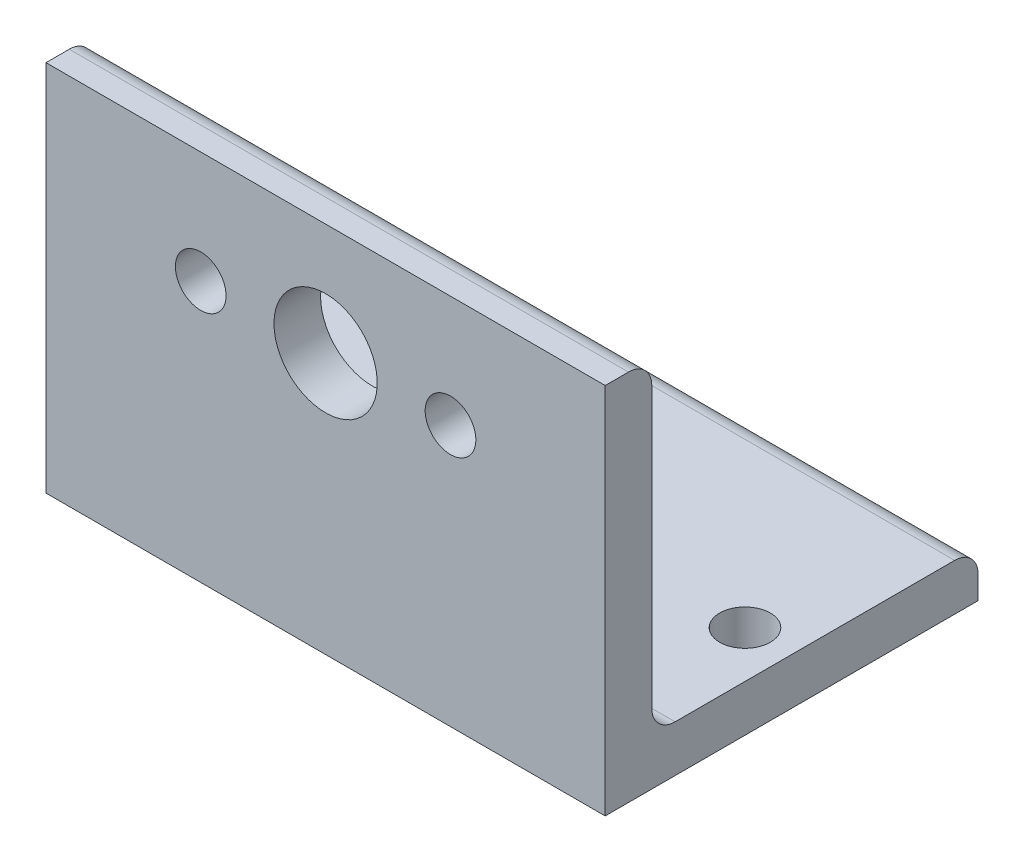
from build123d import *

# Parameters (mm, degrees)
BOSS_EXTRUDE1_DEPTH = 38.1
SKETCH3_R           = 3.5179
SKETCH3_R_2         = 1.7272
CUT_EXTRUDE1_DEPTH  = 51.899122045
SKETCH4_R           = 1.7272
CUT_EXTRUDE2_DEPTH  = 51.899122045
FILLET1_R           = 1.5875


with BuildPart() as part:
    # Sketch2 → Boss-Extrude1 (new body)
    with BuildSketch(Plane(origin=(0, 0, 0), x_dir=(0, 0, -1), z_dir=(1, 0, 0))):
        Polygon((0, 0), (25.4, 0), (25.4, 3.175), (3.175, 3.175), (3.175, 25.4), (0, 25.4), align=None)
    extrude(amount=BOSS_EXTRUDE1_DEPTH)

    # Sketch3 → Cut-Extrude1 (cut, through all)
    with BuildSketch(Plane(origin=(0, 0, -3.175), x_dir=(-1, 0, 0), z_dir=(0, 0, -1))):
        with Locations((-19.05, 17.78)):
            Circle(SKETCH3_R)
        with Locations((-10.541, 17.78)):
            Circle(SKETCH3_R_2)
        with Locations((-27.559, 17.78)):
            Circle(SKETCH3_R_2)
    extrude(amount=-CUT_EXTRUDE1_DEPTH, mode=Mode.SUBTRACT)

    # Sketch4 → Cut-Extrude2 (cut, through all)
    with BuildSketch(Plane(origin=(0, 3.175, 0), x_dir=(1, 0, 0), z_dir=(0, 1, 0))):
        with Locations(Location((3.175, 12.7, 0), (0, 0, 270))):
            Circle(SKETCH4_R)
        with Locations(Location((34.925, 12.7, 0), (0, 0, 270))):
            Circle(SKETCH4_R)
    extrude(amount=-CUT_EXTRUDE2_DEPTH, mode=Mode.SUBTRACT)

    # Fillet1
    fillet1_edges = [part.edges().sort_by_distance(p)[0] for p in [
        (19.05, 25.4, -3.175),
        (19.05, 3.175, -3.175),
        (19.05, 3.175, -25.4),
    ]]
    fillet(fillet1_edges, radius=FILLET1_R)


solid = part.part
